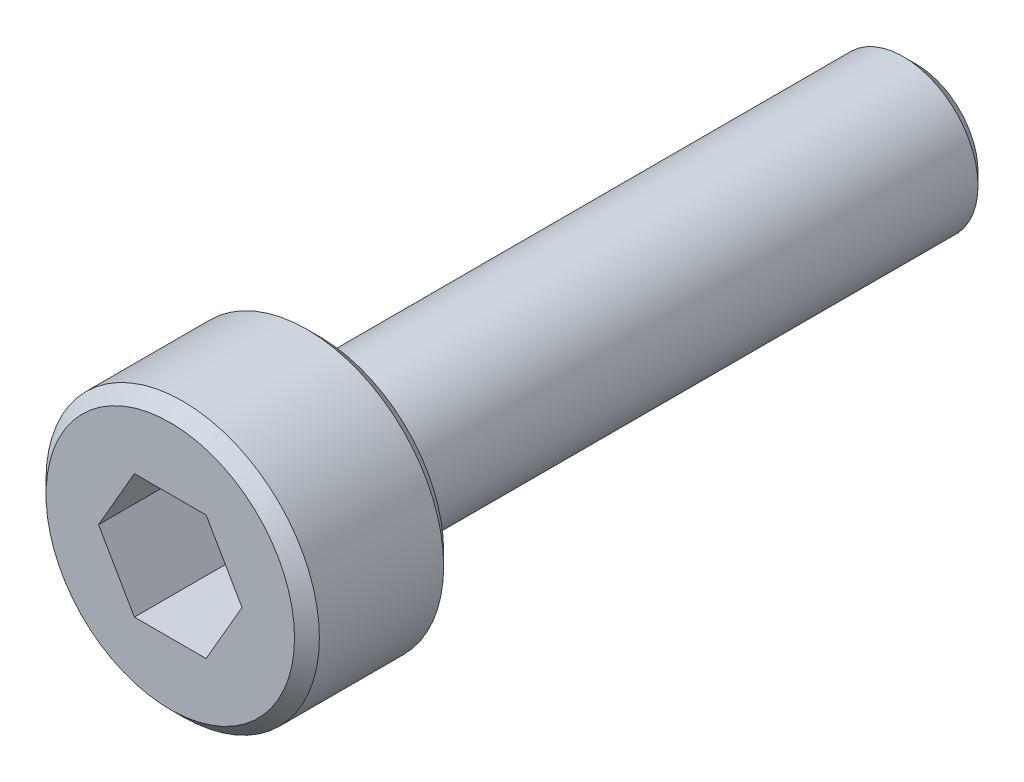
ISO-10303-21;
HEADER;
FILE_DESCRIPTION(('STEP AP214'),'2;1');
FILE_NAME('part.step','',(''),(''),'','','');
FILE_SCHEMA(('AUTOMOTIVE_DESIGN { 1 0 10303 214 1 1 1 1 }'));
ENDSEC;
DATA;
#1=APPLICATION_CONTEXT('core data for automotive mechanical design processes');
#2=APPLICATION_PROTOCOL_DEFINITION('international standard','automotive_design',2000,#1);
#3=PRODUCT_CONTEXT('',#1,'mechanical');
#4=PRODUCT('Part','Part','',(#3));
#5=PRODUCT_RELATED_PRODUCT_CATEGORY('part','',(#4));
#6=PRODUCT_DEFINITION_FORMATION('','',#4);
#7=PRODUCT_DEFINITION_CONTEXT('part definition',#1,'design');
#8=PRODUCT_DEFINITION('design','',#6,#7);
#9=PRODUCT_DEFINITION_SHAPE('','',#8);
#10=(LENGTH_UNIT() NAMED_UNIT(*) SI_UNIT(.MILLI.,.METRE.));
#11=(NAMED_UNIT(*) PLANE_ANGLE_UNIT() SI_UNIT($,.RADIAN.));
#12=(NAMED_UNIT(*) SI_UNIT($,.STERADIAN.) SOLID_ANGLE_UNIT());
#13=UNCERTAINTY_MEASURE_WITH_UNIT(LENGTH_MEASURE(1.E-05),#10,'distance_accuracy_value','');
#14=(GEOMETRIC_REPRESENTATION_CONTEXT(3) GLOBAL_UNCERTAINTY_ASSIGNED_CONTEXT((#13)) GLOBAL_UNIT_ASSIGNED_CONTEXT((#10,
#11,#12)) REPRESENTATION_CONTEXT('',''));
#15=CARTESIAN_POINT('',(0.,0.,0.));
#16=DIRECTION('',(0.,0.,1.));
#17=DIRECTION('',(1.,0.,0.));
#18=AXIS2_PLACEMENT_3D('',#15,#16,#17);
#19=CARTESIAN_POINT('',(0.,0.,12.));
#20=DIRECTION('',(0.,0.,-1.));
#21=DIRECTION('',(-1.,0.,0.));
#22=AXIS2_PLACEMENT_3D('',#19,#20,#21);
#23=CYLINDRICAL_SURFACE('',#22,1.5);
#24=CARTESIAN_POINT('',(0.,0.,0.250000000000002));
#25=DIRECTION('',(0.,0.,1.));
#26=DIRECTION('',(1.,0.,0.));
#27=AXIS2_PLACEMENT_3D('',#24,#25,#26);
#28=CIRCLE('',#27,1.5);
#29=CARTESIAN_POINT('',(1.5,0.,0.250000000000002));
#30=VERTEX_POINT('',#29);
#31=EDGE_CURVE('E188',#30,#30,#28,.T.);
#32=ORIENTED_EDGE('',*,*,#31,.T.);
#33=EDGE_LOOP('',(#32));
#34=FACE_BOUND('',#33,.T.);
#35=CARTESIAN_POINT('',(0.,0.,12.));
#36=DIRECTION('',(0.,0.,1.));
#37=DIRECTION('',(1.,0.,0.));
#38=AXIS2_PLACEMENT_3D('',#35,#36,#37);
#39=CIRCLE('',#38,1.5);
#40=CARTESIAN_POINT('',(1.5,0.,12.));
#41=VERTEX_POINT('',#40);
#42=EDGE_CURVE('E164',#41,#41,#39,.T.);
#43=ORIENTED_EDGE('',*,*,#42,.F.);
#44=EDGE_LOOP('',(#43));
#45=FACE_BOUND('',#44,.T.);
#46=ADVANCED_FACE('F47',(#34,#45),#23,.T.);
#47=CARTESIAN_POINT('',(0.,0.,0.));
#48=DIRECTION('',(0.,0.,1.));
#49=DIRECTION('',(1.,0.,0.));
#50=AXIS2_PLACEMENT_3D('',#47,#48,#49);
#51=PLANE('',#50);
#52=CARTESIAN_POINT('',(0.,0.,0.));
#53=DIRECTION('',(0.,0.,1.));
#54=DIRECTION('',(1.,0.,0.));
#55=AXIS2_PLACEMENT_3D('',#52,#53,#54);
#56=CIRCLE('',#55,1.25);
#57=CARTESIAN_POINT('',(1.25,0.,0.));
#58=VERTEX_POINT('',#57);
#59=EDGE_CURVE('E56',#58,#58,#56,.F.);
#60=ORIENTED_EDGE('',*,*,#59,.T.);
#61=EDGE_LOOP('',(#60));
#62=FACE_BOUND('',#61,.T.);
#63=ADVANCED_FACE('F197',(#62),#51,.F.);
#64=CARTESIAN_POINT('',(0.,0.,15.));
#65=DIRECTION('',(0.,0.,-1.));
#66=DIRECTION('',(-1.,0.,0.));
#67=AXIS2_PLACEMENT_3D('',#64,#65,#66);
#68=CYLINDRICAL_SURFACE('',#67,2.75);
#69=CARTESIAN_POINT('',(0.,0.,12.25));
#70=DIRECTION('',(0.,0.,1.));
#71=DIRECTION('',(1.,0.,0.));
#72=AXIS2_PLACEMENT_3D('',#69,#70,#71);
#73=CIRCLE('',#72,2.75);
#74=CARTESIAN_POINT('',(2.75,0.,12.25));
#75=VERTEX_POINT('',#74);
#76=EDGE_CURVE('E185',#75,#75,#73,.T.);
#77=ORIENTED_EDGE('',*,*,#76,.T.);
#78=EDGE_LOOP('',(#77));
#79=FACE_BOUND('',#78,.T.);
#80=CARTESIAN_POINT('',(0.,0.,14.75));
#81=DIRECTION('',(0.,0.,1.));
#82=DIRECTION('',(1.,0.,0.));
#83=AXIS2_PLACEMENT_3D('',#80,#81,#82);
#84=CIRCLE('',#83,2.75);
#85=CARTESIAN_POINT('',(2.75,0.,14.75));
#86=VERTEX_POINT('',#85);
#87=EDGE_CURVE('E177',#86,#86,#84,.F.);
#88=ORIENTED_EDGE('',*,*,#87,.T.);
#89=EDGE_LOOP('',(#88));
#90=FACE_BOUND('',#89,.T.);
#91=ADVANCED_FACE('F225',(#79,#90),#68,.T.);
#92=CARTESIAN_POINT('',(0.,0.,15.));
#93=DIRECTION('',(0.,0.,1.));
#94=DIRECTION('',(1.,0.,0.));
#95=AXIS2_PLACEMENT_3D('',#92,#93,#94);
#96=PLANE('',#95);
#97=DIRECTION('',(0.5,0.866025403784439,0.));
#98=VECTOR('',#97,1.);
#99=CARTESIAN_POINT('',(0.721687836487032,-1.25,15.));
#100=LINE('',#99,#98);
#101=CARTESIAN_POINT('',(0.721687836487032,-1.25,15.));
#102=VERTEX_POINT('',#101);
#103=CARTESIAN_POINT('',(1.44337567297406,0.,15.));
#104=VERTEX_POINT('',#103);
#105=EDGE_CURVE('E68',#102,#104,#100,.T.);
#106=ORIENTED_EDGE('',*,*,#105,.F.);
#107=DIRECTION('',(1.,0.,0.));
#108=VECTOR('',#107,1.);
#109=CARTESIAN_POINT('',(-0.721687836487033,-1.25,15.));
#110=LINE('',#109,#108);
#111=CARTESIAN_POINT('',(-0.721687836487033,-1.25,15.));
#112=VERTEX_POINT('',#111);
#113=EDGE_CURVE('E157',#112,#102,#110,.T.);
#114=ORIENTED_EDGE('',*,*,#113,.F.);
#115=DIRECTION('',(0.5,-0.866025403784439,0.));
#116=VECTOR('',#115,1.);
#117=CARTESIAN_POINT('',(-1.44337567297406,0.,15.));
#118=LINE('',#117,#116);
#119=CARTESIAN_POINT('',(-1.44337567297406,0.,15.));
#120=VERTEX_POINT('',#119);
#121=EDGE_CURVE('E156',#120,#112,#118,.T.);
#122=ORIENTED_EDGE('',*,*,#121,.F.);
#123=DIRECTION('',(-0.5,-0.866025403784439,0.));
#124=VECTOR('',#123,1.);
#125=CARTESIAN_POINT('',(-0.721687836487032,1.25,15.));
#126=LINE('',#125,#124);
#127=CARTESIAN_POINT('',(-0.721687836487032,1.25,15.));
#128=VERTEX_POINT('',#127);
#129=EDGE_CURVE('E111',#128,#120,#126,.T.);
#130=ORIENTED_EDGE('',*,*,#129,.F.);
#131=DIRECTION('',(-1.,0.,0.));
#132=VECTOR('',#131,1.);
#133=CARTESIAN_POINT('',(0.721687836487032,1.25,15.));
#134=LINE('',#133,#132);
#135=CARTESIAN_POINT('',(0.721687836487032,1.25,15.));
#136=VERTEX_POINT('',#135);
#137=EDGE_CURVE('E147',#136,#128,#134,.T.);
#138=ORIENTED_EDGE('',*,*,#137,.F.);
#139=DIRECTION('',(-0.5,0.866025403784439,0.));
#140=VECTOR('',#139,1.);
#141=CARTESIAN_POINT('',(1.44337567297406,0.,15.));
#142=LINE('',#141,#140);
#143=EDGE_CURVE('E148',#104,#136,#142,.T.);
#144=ORIENTED_EDGE('',*,*,#143,.F.);
#145=EDGE_LOOP('',(#106,#114,#122,#130,#138,#144));
#146=FACE_BOUND('',#145,.T.);
#147=CARTESIAN_POINT('',(0.,0.,15.));
#148=DIRECTION('',(0.,0.,1.));
#149=DIRECTION('',(1.,0.,0.));
#150=AXIS2_PLACEMENT_3D('',#147,#148,#149);
#151=CIRCLE('',#150,2.5);
#152=CARTESIAN_POINT('',(2.5,0.,15.));
#153=VERTEX_POINT('',#152);
#154=EDGE_CURVE('E11',#153,#153,#151,.T.);
#155=ORIENTED_EDGE('',*,*,#154,.T.);
#156=EDGE_LOOP('',(#155));
#157=FACE_BOUND('',#156,.T.);
#158=ADVANCED_FACE('F215',(#146,#157),#96,.T.);
#159=CARTESIAN_POINT('',(0.,0.,12.));
#160=DIRECTION('',(0.,0.,1.));
#161=DIRECTION('',(1.,0.,0.));
#162=AXIS2_PLACEMENT_3D('',#159,#160,#161);
#163=PLANE('',#162);
#164=CARTESIAN_POINT('',(0.,0.,12.));
#165=DIRECTION('',(0.,0.,1.));
#166=DIRECTION('',(1.,0.,0.));
#167=AXIS2_PLACEMENT_3D('',#164,#165,#166);
#168=CIRCLE('',#167,2.5);
#169=CARTESIAN_POINT('',(2.5,0.,12.));
#170=VERTEX_POINT('',#169);
#171=EDGE_CURVE('E187',#170,#170,#168,.F.);
#172=ORIENTED_EDGE('',*,*,#171,.T.);
#173=EDGE_LOOP('',(#172));
#174=FACE_BOUND('',#173,.T.);
#175=ORIENTED_EDGE('',*,*,#42,.T.);
#176=EDGE_LOOP('',(#175));
#177=FACE_BOUND('',#176,.T.);
#178=ADVANCED_FACE('F209',(#174,#177),#163,.F.);
#179=CARTESIAN_POINT('',(0.,0.,12.25));
#180=DIRECTION('',(0.,0.,1.));
#181=DIRECTION('',(1.,0.,0.));
#182=AXIS2_PLACEMENT_3D('',#179,#180,#181);
#183=CONICAL_SURFACE('',#182,2.75,0.785398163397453);
#184=ORIENTED_EDGE('',*,*,#171,.F.);
#185=EDGE_LOOP('',(#184));
#186=FACE_BOUND('',#185,.T.);
#187=ORIENTED_EDGE('',*,*,#76,.F.);
#188=EDGE_LOOP('',(#187));
#189=FACE_BOUND('',#188,.T.);
#190=ADVANCED_FACE('F205',(#186,#189),#183,.T.);
#191=CARTESIAN_POINT('',(0.,0.,0.250000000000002));
#192=DIRECTION('',(0.,0.,1.));
#193=DIRECTION('',(1.,0.,0.));
#194=AXIS2_PLACEMENT_3D('',#191,#192,#193);
#195=CONICAL_SURFACE('',#194,1.5,0.785398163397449);
#196=ORIENTED_EDGE('',*,*,#59,.F.);
#197=EDGE_LOOP('',(#196));
#198=FACE_BOUND('',#197,.T.);
#199=ORIENTED_EDGE('',*,*,#31,.F.);
#200=EDGE_LOOP('',(#199));
#201=FACE_BOUND('',#200,.T.);
#202=ADVANCED_FACE('F200',(#198,#201),#195,.T.);
#203=CARTESIAN_POINT('',(0.,0.,15.));
#204=DIRECTION('',(0.,0.,-1.));
#205=DIRECTION('',(-1.,0.,0.));
#206=AXIS2_PLACEMENT_3D('',#203,#204,#205);
#207=CONICAL_SURFACE('',#206,2.5,0.785398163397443);
#208=ORIENTED_EDGE('',*,*,#87,.F.);
#209=EDGE_LOOP('',(#208));
#210=FACE_BOUND('',#209,.T.);
#211=ORIENTED_EDGE('',*,*,#154,.F.);
#212=EDGE_LOOP('',(#211));
#213=FACE_BOUND('',#212,.T.);
#214=ADVANCED_FACE('F55',(#210,#213),#207,.T.);
#215=CARTESIAN_POINT('',(0.721687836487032,-1.25,13.));
#216=DIRECTION('',(0.866025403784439,-0.5,0.));
#217=DIRECTION('',(0.5,0.866025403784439,0.));
#218=AXIS2_PLACEMENT_3D('',#215,#216,#217);
#219=PLANE('',#218);
#220=ORIENTED_EDGE('',*,*,#105,.T.);
#221=DIRECTION('',(0.,0.,1.));
#222=VECTOR('',#221,1.);
#223=CARTESIAN_POINT('',(1.44337567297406,0.,13.));
#224=LINE('',#223,#222);
#225=CARTESIAN_POINT('',(1.44337567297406,0.,13.));
#226=VERTEX_POINT('',#225);
#227=EDGE_CURVE('E96',#226,#104,#224,.T.);
#228=ORIENTED_EDGE('',*,*,#227,.F.);
#229=DIRECTION('',(0.5,0.866025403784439,0.));
#230=VECTOR('',#229,1.);
#231=CARTESIAN_POINT('',(0.721687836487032,-1.25,13.));
#232=LINE('',#231,#230);
#233=CARTESIAN_POINT('',(0.721687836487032,-1.25,13.));
#234=VERTEX_POINT('',#233);
#235=EDGE_CURVE('E165',#234,#226,#232,.T.);
#236=ORIENTED_EDGE('',*,*,#235,.F.);
#237=DIRECTION('',(0.,0.,1.));
#238=VECTOR('',#237,1.);
#239=CARTESIAN_POINT('',(0.721687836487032,-1.25,13.));
#240=LINE('',#239,#238);
#241=EDGE_CURVE('E74',#234,#102,#240,.T.);
#242=ORIENTED_EDGE('',*,*,#241,.T.);
#243=EDGE_LOOP('',(#220,#228,#236,#242));
#244=FACE_BOUND('',#243,.T.);
#245=ADVANCED_FACE('F278',(#244),#219,.F.);
#246=CARTESIAN_POINT('',(-0.721687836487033,-1.25,13.));
#247=DIRECTION('',(0.,-1.,0.));
#248=DIRECTION('',(1.,0.,0.));
#249=AXIS2_PLACEMENT_3D('',#246,#247,#248);
#250=PLANE('',#249);
#251=ORIENTED_EDGE('',*,*,#113,.T.);
#252=ORIENTED_EDGE('',*,*,#241,.F.);
#253=DIRECTION('',(1.,0.,0.));
#254=VECTOR('',#253,1.);
#255=CARTESIAN_POINT('',(-0.721687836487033,-1.25,13.));
#256=LINE('',#255,#254);
#257=CARTESIAN_POINT('',(-0.721687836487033,-1.25,13.));
#258=VERTEX_POINT('',#257);
#259=EDGE_CURVE('E126',#258,#234,#256,.T.);
#260=ORIENTED_EDGE('',*,*,#259,.F.);
#261=DIRECTION('',(0.,0.,1.));
#262=VECTOR('',#261,1.);
#263=CARTESIAN_POINT('',(-0.721687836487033,-1.25,13.));
#264=LINE('',#263,#262);
#265=EDGE_CURVE('E116',#258,#112,#264,.T.);
#266=ORIENTED_EDGE('',*,*,#265,.T.);
#267=EDGE_LOOP('',(#251,#252,#260,#266));
#268=FACE_BOUND('',#267,.T.);
#269=ADVANCED_FACE('F287',(#268),#250,.F.);
#270=CARTESIAN_POINT('',(-1.44337567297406,0.,13.));
#271=DIRECTION('',(-0.866025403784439,-0.5,0.));
#272=DIRECTION('',(0.5,-0.866025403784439,0.));
#273=AXIS2_PLACEMENT_3D('',#270,#271,#272);
#274=PLANE('',#273);
#275=ORIENTED_EDGE('',*,*,#121,.T.);
#276=ORIENTED_EDGE('',*,*,#265,.F.);
#277=DIRECTION('',(0.5,-0.866025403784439,0.));
#278=VECTOR('',#277,1.);
#279=CARTESIAN_POINT('',(-1.44337567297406,0.,13.));
#280=LINE('',#279,#278);
#281=CARTESIAN_POINT('',(-1.44337567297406,0.,13.));
#282=VERTEX_POINT('',#281);
#283=EDGE_CURVE('E122',#282,#258,#280,.T.);
#284=ORIENTED_EDGE('',*,*,#283,.F.);
#285=DIRECTION('',(0.,0.,1.));
#286=VECTOR('',#285,1.);
#287=CARTESIAN_POINT('',(-1.44337567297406,0.,13.));
#288=LINE('',#287,#286);
#289=EDGE_CURVE('E110',#282,#120,#288,.T.);
#290=ORIENTED_EDGE('',*,*,#289,.T.);
#291=EDGE_LOOP('',(#275,#276,#284,#290));
#292=FACE_BOUND('',#291,.T.);
#293=ADVANCED_FACE('F125',(#292),#274,.F.);
#294=CARTESIAN_POINT('',(-0.721687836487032,1.25,13.));
#295=DIRECTION('',(-0.866025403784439,0.5,0.));
#296=DIRECTION('',(-0.5,-0.866025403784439,0.));
#297=AXIS2_PLACEMENT_3D('',#294,#295,#296);
#298=PLANE('',#297);
#299=ORIENTED_EDGE('',*,*,#129,.T.);
#300=ORIENTED_EDGE('',*,*,#289,.F.);
#301=DIRECTION('',(-0.5,-0.866025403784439,0.));
#302=VECTOR('',#301,1.);
#303=CARTESIAN_POINT('',(-0.721687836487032,1.25,13.));
#304=LINE('',#303,#302);
#305=CARTESIAN_POINT('',(-0.721687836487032,1.25,13.));
#306=VERTEX_POINT('',#305);
#307=EDGE_CURVE('E112',#306,#282,#304,.T.);
#308=ORIENTED_EDGE('',*,*,#307,.F.);
#309=DIRECTION('',(0.,0.,1.));
#310=VECTOR('',#309,1.);
#311=CARTESIAN_POINT('',(-0.721687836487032,1.25,13.));
#312=LINE('',#311,#310);
#313=EDGE_CURVE('E118',#306,#128,#312,.T.);
#314=ORIENTED_EDGE('',*,*,#313,.T.);
#315=EDGE_LOOP('',(#299,#300,#308,#314));
#316=FACE_BOUND('',#315,.T.);
#317=ADVANCED_FACE('F108',(#316),#298,.F.);
#318=CARTESIAN_POINT('',(0.721687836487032,1.25,13.));
#319=DIRECTION('',(0.,1.,0.));
#320=DIRECTION('',(-1.,0.,0.));
#321=AXIS2_PLACEMENT_3D('',#318,#319,#320);
#322=PLANE('',#321);
#323=ORIENTED_EDGE('',*,*,#137,.T.);
#324=ORIENTED_EDGE('',*,*,#313,.F.);
#325=DIRECTION('',(-1.,0.,0.));
#326=VECTOR('',#325,1.);
#327=CARTESIAN_POINT('',(0.721687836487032,1.25,13.));
#328=LINE('',#327,#326);
#329=CARTESIAN_POINT('',(0.721687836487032,1.25,13.));
#330=VERTEX_POINT('',#329);
#331=EDGE_CURVE('E131',#330,#306,#328,.T.);
#332=ORIENTED_EDGE('',*,*,#331,.F.);
#333=DIRECTION('',(0.,0.,1.));
#334=VECTOR('',#333,1.);
#335=CARTESIAN_POINT('',(0.721687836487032,1.25,13.));
#336=LINE('',#335,#334);
#337=EDGE_CURVE('E168',#330,#136,#336,.T.);
#338=ORIENTED_EDGE('',*,*,#337,.T.);
#339=EDGE_LOOP('',(#323,#324,#332,#338));
#340=FACE_BOUND('',#339,.T.);
#341=ADVANCED_FACE('F315',(#340),#322,.F.);
#342=CARTESIAN_POINT('',(1.44337567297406,0.,13.));
#343=DIRECTION('',(0.866025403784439,0.5,0.));
#344=DIRECTION('',(-0.5,0.866025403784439,0.));
#345=AXIS2_PLACEMENT_3D('',#342,#343,#344);
#346=PLANE('',#345);
#347=ORIENTED_EDGE('',*,*,#143,.T.);
#348=ORIENTED_EDGE('',*,*,#337,.F.);
#349=DIRECTION('',(-0.5,0.866025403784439,0.));
#350=VECTOR('',#349,1.);
#351=CARTESIAN_POINT('',(1.44337567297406,0.,13.));
#352=LINE('',#351,#350);
#353=EDGE_CURVE('E137',#226,#330,#352,.T.);
#354=ORIENTED_EDGE('',*,*,#353,.F.);
#355=ORIENTED_EDGE('',*,*,#227,.T.);
#356=EDGE_LOOP('',(#347,#348,#354,#355));
#357=FACE_BOUND('',#356,.T.);
#358=ADVANCED_FACE('F321',(#357),#346,.F.);
#359=CARTESIAN_POINT('',(0.,0.,13.));
#360=DIRECTION('',(0.,0.,1.));
#361=DIRECTION('',(1.,0.,0.));
#362=AXIS2_PLACEMENT_3D('',#359,#360,#361);
#363=PLANE('',#362);
#364=ORIENTED_EDGE('',*,*,#235,.T.);
#365=ORIENTED_EDGE('',*,*,#353,.T.);
#366=ORIENTED_EDGE('',*,*,#331,.T.);
#367=ORIENTED_EDGE('',*,*,#307,.T.);
#368=ORIENTED_EDGE('',*,*,#283,.T.);
#369=ORIENTED_EDGE('',*,*,#259,.T.);
#370=EDGE_LOOP('',(#364,#365,#366,#367,#368,#369));
#371=FACE_BOUND('',#370,.T.);
#372=ADVANCED_FACE('F132',(#371),#363,.T.);
#373=CLOSED_SHELL('',(#46,#63,#91,#158,#178,#190,#202,#214,#245,#269,#293,#317,#341,#358,#372));
#374=MANIFOLD_SOLID_BREP('B2',#373);
#375=ADVANCED_BREP_SHAPE_REPRESENTATION('',(#18,#374),#14);
#376=SHAPE_DEFINITION_REPRESENTATION(#9,#375);
ENDSEC;
END-ISO-10303-21;
